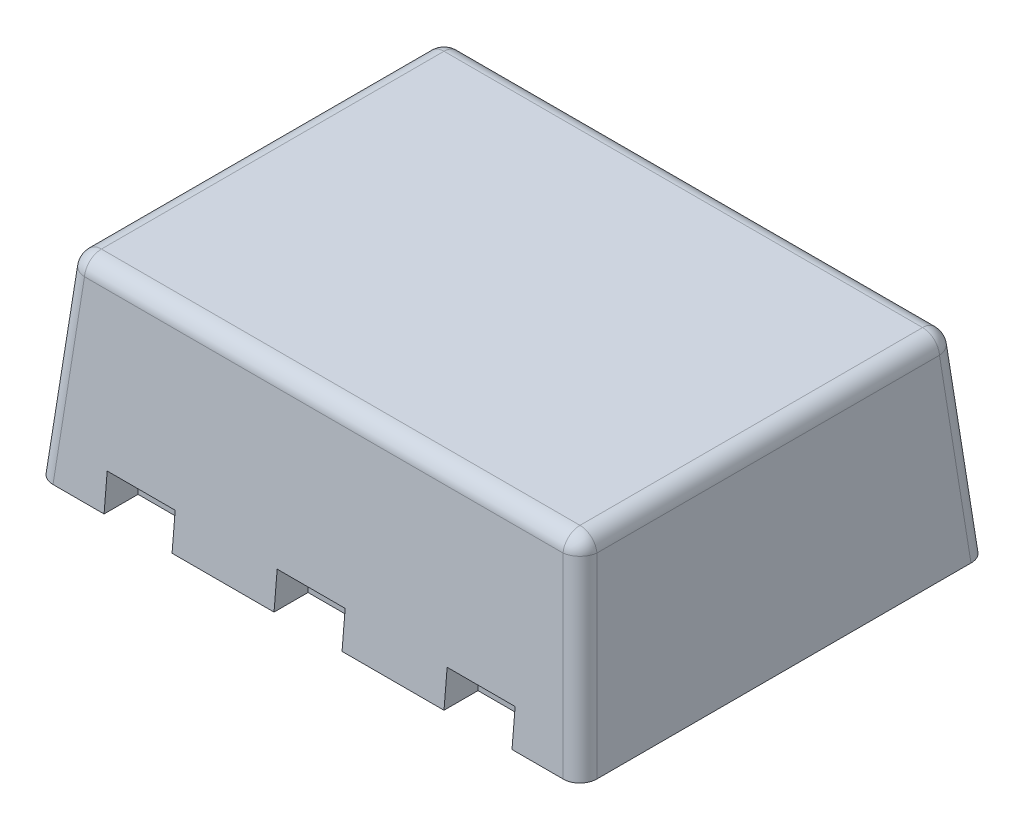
ISO-10303-21;
HEADER;
FILE_DESCRIPTION(('STEP AP214'),'2;1');
FILE_NAME('part.step','',(''),(''),'','','');
FILE_SCHEMA(('AUTOMOTIVE_DESIGN { 1 0 10303 214 1 1 1 1 }'));
ENDSEC;
DATA;
#1=APPLICATION_CONTEXT('core data for automotive mechanical design processes');
#2=APPLICATION_PROTOCOL_DEFINITION('international standard','automotive_design',2000,#1);
#3=PRODUCT_CONTEXT('',#1,'mechanical');
#4=PRODUCT('Part','Part','',(#3));
#5=PRODUCT_RELATED_PRODUCT_CATEGORY('part','',(#4));
#6=PRODUCT_DEFINITION_FORMATION('','',#4);
#7=PRODUCT_DEFINITION_CONTEXT('part definition',#1,'design');
#8=PRODUCT_DEFINITION('design','',#6,#7);
#9=PRODUCT_DEFINITION_SHAPE('','',#8);
#10=(LENGTH_UNIT() NAMED_UNIT(*) SI_UNIT(.MILLI.,.METRE.));
#11=(NAMED_UNIT(*) PLANE_ANGLE_UNIT() SI_UNIT($,.RADIAN.));
#12=(NAMED_UNIT(*) SI_UNIT($,.STERADIAN.) SOLID_ANGLE_UNIT());
#13=UNCERTAINTY_MEASURE_WITH_UNIT(LENGTH_MEASURE(1.E-05),#10,'distance_accuracy_value','');
#14=(GEOMETRIC_REPRESENTATION_CONTEXT(3) GLOBAL_UNCERTAINTY_ASSIGNED_CONTEXT((#13)) GLOBAL_UNIT_ASSIGNED_CONTEXT((#10,
#11,#12)) REPRESENTATION_CONTEXT('',''));
#15=CARTESIAN_POINT('',(0.,0.,0.));
#16=DIRECTION('',(0.,0.,1.));
#17=DIRECTION('',(1.,0.,0.));
#18=AXIS2_PLACEMENT_3D('',#15,#16,#17);
#19=CARTESIAN_POINT('',(0.,0.105,0.));
#20=DIRECTION('',(0.,-1.,0.));
#21=DIRECTION('',(0.,0.,-1.));
#22=AXIS2_PLACEMENT_3D('',#19,#20,#21);
#23=PLANE('',#22);
#24=DIRECTION('',(0.,0.,-1.));
#25=VECTOR('',#24,1.);
#26=CARTESIAN_POINT('',(-0.6,0.105,0.59081369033));
#27=LINE('',#26,#25);
#28=CARTESIAN_POINT('',(-0.6,0.105,0.59081369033));
#29=VERTEX_POINT('',#28);
#30=CARTESIAN_POINT('',(-0.6,0.105,0.5));
#31=VERTEX_POINT('',#30);
#32=EDGE_CURVE('E11',#29,#31,#27,.T.);
#33=ORIENTED_EDGE('',*,*,#32,.T.);
#34=DIRECTION('',(1.,0.,0.));
#35=VECTOR('',#34,1.);
#36=CARTESIAN_POINT('',(-0.6,0.105,0.5));
#37=LINE('',#36,#35);
#38=CARTESIAN_POINT('',(-0.4,0.105,0.5));
#39=VERTEX_POINT('',#38);
#40=EDGE_CURVE('E47',#31,#39,#37,.T.);
#41=ORIENTED_EDGE('',*,*,#40,.T.);
#42=DIRECTION('',(0.,0.,1.));
#43=VECTOR('',#42,1.);
#44=CARTESIAN_POINT('',(-0.4,0.105,0.5));
#45=LINE('',#44,#43);
#46=CARTESIAN_POINT('',(-0.4,0.105,0.59081369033));
#47=VERTEX_POINT('',#46);
#48=EDGE_CURVE('E463',#39,#47,#45,.T.);
#49=ORIENTED_EDGE('',*,*,#48,.T.);
#50=DIRECTION('',(1.,0.,0.));
#51=VECTOR('',#50,1.);
#52=CARTESIAN_POINT('',(-0.6,0.105,0.59081369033));
#53=LINE('',#52,#51);
#54=EDGE_CURVE('E407',#29,#47,#53,.T.);
#55=ORIENTED_EDGE('',*,*,#54,.F.);
#56=EDGE_LOOP('',(#33,#41,#49,#55));
#57=FACE_BOUND('',#56,.T.);
#58=ADVANCED_FACE('F17',(#57),#23,.T.);
#59=CARTESIAN_POINT('',(-0.6,-0.025,0.8));
#60=DIRECTION('',(1.,0.,0.));
#61=DIRECTION('',(0.,1.,0.));
#62=AXIS2_PLACEMENT_3D('',#59,#60,#61);
#63=PLANE('',#62);
#64=DIRECTION('',(0.,1.,0.));
#65=VECTOR('',#64,1.);
#66=CARTESIAN_POINT('',(-0.6,0.,0.5));
#67=LINE('',#66,#65);
#68=CARTESIAN_POINT('',(-0.6,0.,0.5));
#69=VERTEX_POINT('',#68);
#70=EDGE_CURVE('E26',#69,#31,#67,.T.);
#71=ORIENTED_EDGE('',*,*,#70,.T.);
#72=ORIENTED_EDGE('',*,*,#32,.F.);
#73=DIRECTION('',(0.,0.996194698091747,-0.0871557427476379));
#74=VECTOR('',#73,1.);
#75=CARTESIAN_POINT('',(-0.6,0.,0.6));
#76=LINE('',#75,#74);
#77=CARTESIAN_POINT('',(-0.6,0.,0.6));
#78=VERTEX_POINT('',#77);
#79=EDGE_CURVE('E403',#78,#29,#76,.T.);
#80=ORIENTED_EDGE('',*,*,#79,.F.);
#81=DIRECTION('',(0.,0.,-1.));
#82=VECTOR('',#81,1.);
#83=CARTESIAN_POINT('',(-0.6,0.,0.6));
#84=LINE('',#83,#82);
#85=EDGE_CURVE('E383',#78,#69,#84,.T.);
#86=ORIENTED_EDGE('',*,*,#85,.T.);
#87=EDGE_LOOP('',(#71,#72,#80,#86));
#88=FACE_BOUND('',#87,.T.);
#89=ADVANCED_FACE('F887',(#88),#63,.T.);
#90=CARTESIAN_POINT('',(-0.6,-0.025,0.5));
#91=DIRECTION('',(0.,0.,1.));
#92=DIRECTION('',(1.,0.,0.));
#93=AXIS2_PLACEMENT_3D('',#90,#91,#92);
#94=PLANE('',#93);
#95=DIRECTION('',(0.,1.,0.));
#96=VECTOR('',#95,1.);
#97=CARTESIAN_POINT('',(-0.4,0.,0.5));
#98=LINE('',#97,#96);
#99=CARTESIAN_POINT('',(-0.4,0.,0.5));
#100=VERTEX_POINT('',#99);
#101=EDGE_CURVE('E465',#100,#39,#98,.T.);
#102=ORIENTED_EDGE('',*,*,#101,.T.);
#103=ORIENTED_EDGE('',*,*,#40,.F.);
#104=ORIENTED_EDGE('',*,*,#70,.F.);
#105=DIRECTION('',(1.,0.,0.));
#106=VECTOR('',#105,1.);
#107=CARTESIAN_POINT('',(-0.6,0.,0.5));
#108=LINE('',#107,#106);
#109=EDGE_CURVE('E382',#69,#100,#108,.T.);
#110=ORIENTED_EDGE('',*,*,#109,.T.);
#111=EDGE_LOOP('',(#102,#103,#104,#110));
#112=FACE_BOUND('',#111,.T.);
#113=ADVANCED_FACE('F885',(#112),#94,.T.);
#114=CARTESIAN_POINT('',(-0.4,-0.025,0.5));
#115=DIRECTION('',(-1.,0.,0.));
#116=DIRECTION('',(0.,0.,1.));
#117=AXIS2_PLACEMENT_3D('',#114,#115,#116);
#118=PLANE('',#117);
#119=DIRECTION('',(0.,0.996194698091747,-0.0871557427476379));
#120=VECTOR('',#119,1.);
#121=CARTESIAN_POINT('',(-0.4,0.,0.6));
#122=LINE('',#121,#120);
#123=CARTESIAN_POINT('',(-0.4,0.,0.6));
#124=VERTEX_POINT('',#123);
#125=EDGE_CURVE('E587',#124,#47,#122,.T.);
#126=ORIENTED_EDGE('',*,*,#125,.T.);
#127=ORIENTED_EDGE('',*,*,#48,.F.);
#128=ORIENTED_EDGE('',*,*,#101,.F.);
#129=DIRECTION('',(0.,0.,-1.));
#130=VECTOR('',#129,1.);
#131=CARTESIAN_POINT('',(-0.4,0.,0.6));
#132=LINE('',#131,#130);
#133=EDGE_CURVE('E374',#124,#100,#132,.T.);
#134=ORIENTED_EDGE('',*,*,#133,.F.);
#135=EDGE_LOOP('',(#126,#127,#128,#134));
#136=FACE_BOUND('',#135,.T.);
#137=ADVANCED_FACE('F860',(#136),#118,.T.);
#138=CARTESIAN_POINT('',(0.,0.105,0.));
#139=DIRECTION('',(0.,-1.,0.));
#140=DIRECTION('',(0.,0.,-1.));
#141=AXIS2_PLACEMENT_3D('',#138,#139,#140);
#142=PLANE('',#141);
#143=DIRECTION('',(0.,0.,-1.));
#144=VECTOR('',#143,1.);
#145=CARTESIAN_POINT('',(-0.1,0.105,0.59081369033));
#146=LINE('',#145,#144);
#147=CARTESIAN_POINT('',(-0.1,0.105,0.59081369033));
#148=VERTEX_POINT('',#147);
#149=CARTESIAN_POINT('',(-0.1,0.105,0.5));
#150=VERTEX_POINT('',#149);
#151=EDGE_CURVE('E466',#148,#150,#146,.T.);
#152=ORIENTED_EDGE('',*,*,#151,.T.);
#153=DIRECTION('',(1.,0.,0.));
#154=VECTOR('',#153,1.);
#155=CARTESIAN_POINT('',(-0.1,0.105,0.5));
#156=LINE('',#155,#154);
#157=CARTESIAN_POINT('',(0.1,0.105,0.5));
#158=VERTEX_POINT('',#157);
#159=EDGE_CURVE('E77',#150,#158,#156,.T.);
#160=ORIENTED_EDGE('',*,*,#159,.T.);
#161=DIRECTION('',(0.,0.,1.));
#162=VECTOR('',#161,1.);
#163=CARTESIAN_POINT('',(0.1,0.105,0.5));
#164=LINE('',#163,#162);
#165=CARTESIAN_POINT('',(0.1,0.105,0.59081369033));
#166=VERTEX_POINT('',#165);
#167=EDGE_CURVE('E596',#158,#166,#164,.T.);
#168=ORIENTED_EDGE('',*,*,#167,.T.);
#169=DIRECTION('',(1.,0.,0.));
#170=VECTOR('',#169,1.);
#171=CARTESIAN_POINT('',(-0.1,0.105,0.59081369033));
#172=LINE('',#171,#170);
#173=EDGE_CURVE('E472',#148,#166,#172,.T.);
#174=ORIENTED_EDGE('',*,*,#173,.F.);
#175=EDGE_LOOP('',(#152,#160,#168,#174));
#176=FACE_BOUND('',#175,.T.);
#177=ADVANCED_FACE('F856',(#176),#142,.T.);
#178=CARTESIAN_POINT('',(-0.1,-0.025,0.8));
#179=DIRECTION('',(1.,0.,0.));
#180=DIRECTION('',(0.,1.,0.));
#181=AXIS2_PLACEMENT_3D('',#178,#179,#180);
#182=PLANE('',#181);
#183=DIRECTION('',(0.,1.,0.));
#184=VECTOR('',#183,1.);
#185=CARTESIAN_POINT('',(-0.1,0.,0.5));
#186=LINE('',#185,#184);
#187=CARTESIAN_POINT('',(-0.1,0.,0.5));
#188=VERTEX_POINT('',#187);
#189=EDGE_CURVE('E565',#188,#150,#186,.T.);
#190=ORIENTED_EDGE('',*,*,#189,.T.);
#191=ORIENTED_EDGE('',*,*,#151,.F.);
#192=DIRECTION('',(0.,0.996194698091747,-0.0871557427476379));
#193=VECTOR('',#192,1.);
#194=CARTESIAN_POINT('',(-0.1,0.,0.6));
#195=LINE('',#194,#193);
#196=CARTESIAN_POINT('',(-0.1,0.,0.6));
#197=VERTEX_POINT('',#196);
#198=EDGE_CURVE('E477',#197,#148,#195,.T.);
#199=ORIENTED_EDGE('',*,*,#198,.F.);
#200=DIRECTION('',(0.,0.,-1.));
#201=VECTOR('',#200,1.);
#202=CARTESIAN_POINT('',(-0.1,0.,0.6));
#203=LINE('',#202,#201);
#204=EDGE_CURVE('E354',#197,#188,#203,.T.);
#205=ORIENTED_EDGE('',*,*,#204,.T.);
#206=EDGE_LOOP('',(#190,#191,#199,#205));
#207=FACE_BOUND('',#206,.T.);
#208=ADVANCED_FACE('F859',(#207),#182,.T.);
#209=CARTESIAN_POINT('',(-0.1,-0.025,0.5));
#210=DIRECTION('',(0.,0.,1.));
#211=DIRECTION('',(1.,0.,0.));
#212=AXIS2_PLACEMENT_3D('',#209,#210,#211);
#213=PLANE('',#212);
#214=DIRECTION('',(0.,1.,0.));
#215=VECTOR('',#214,1.);
#216=CARTESIAN_POINT('',(0.1,0.,0.5));
#217=LINE('',#216,#215);
#218=CARTESIAN_POINT('',(0.1,0.,0.5));
#219=VERTEX_POINT('',#218);
#220=EDGE_CURVE('E566',#219,#158,#217,.T.);
#221=ORIENTED_EDGE('',*,*,#220,.T.);
#222=ORIENTED_EDGE('',*,*,#159,.F.);
#223=ORIENTED_EDGE('',*,*,#189,.F.);
#224=DIRECTION('',(1.,0.,0.));
#225=VECTOR('',#224,1.);
#226=CARTESIAN_POINT('',(-0.1,0.,0.5));
#227=LINE('',#226,#225);
#228=EDGE_CURVE('E359',#188,#219,#227,.T.);
#229=ORIENTED_EDGE('',*,*,#228,.T.);
#230=EDGE_LOOP('',(#221,#222,#223,#229));
#231=FACE_BOUND('',#230,.T.);
#232=ADVANCED_FACE('F876',(#231),#213,.T.);
#233=CARTESIAN_POINT('',(0.1,-0.025,0.5));
#234=DIRECTION('',(-1.,0.,0.));
#235=DIRECTION('',(0.,0.,1.));
#236=AXIS2_PLACEMENT_3D('',#233,#234,#235);
#237=PLANE('',#236);
#238=DIRECTION('',(0.,0.996194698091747,-0.0871557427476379));
#239=VECTOR('',#238,1.);
#240=CARTESIAN_POINT('',(0.1,0.,0.6));
#241=LINE('',#240,#239);
#242=CARTESIAN_POINT('',(0.1,0.,0.6));
#243=VERTEX_POINT('',#242);
#244=EDGE_CURVE('E476',#243,#166,#241,.T.);
#245=ORIENTED_EDGE('',*,*,#244,.T.);
#246=ORIENTED_EDGE('',*,*,#167,.F.);
#247=ORIENTED_EDGE('',*,*,#220,.F.);
#248=DIRECTION('',(0.,0.,-1.));
#249=VECTOR('',#248,1.);
#250=CARTESIAN_POINT('',(0.1,0.,0.6));
#251=LINE('',#250,#249);
#252=EDGE_CURVE('E378',#243,#219,#251,.T.);
#253=ORIENTED_EDGE('',*,*,#252,.F.);
#254=EDGE_LOOP('',(#245,#246,#247,#253));
#255=FACE_BOUND('',#254,.T.);
#256=ADVANCED_FACE('F873',(#255),#237,.T.);
#257=CARTESIAN_POINT('',(0.,0.105,0.));
#258=DIRECTION('',(0.,-1.,0.));
#259=DIRECTION('',(0.,0.,-1.));
#260=AXIS2_PLACEMENT_3D('',#257,#258,#259);
#261=PLANE('',#260);
#262=DIRECTION('',(0.,0.,-1.));
#263=VECTOR('',#262,1.);
#264=CARTESIAN_POINT('',(0.4,0.105,0.59081369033));
#265=LINE('',#264,#263);
#266=CARTESIAN_POINT('',(0.4,0.105,0.59081369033));
#267=VERTEX_POINT('',#266);
#268=CARTESIAN_POINT('',(0.4,0.105,0.5));
#269=VERTEX_POINT('',#268);
#270=EDGE_CURVE('E66',#267,#269,#265,.T.);
#271=ORIENTED_EDGE('',*,*,#270,.T.);
#272=DIRECTION('',(1.,0.,0.));
#273=VECTOR('',#272,1.);
#274=CARTESIAN_POINT('',(0.4,0.105,0.5));
#275=LINE('',#274,#273);
#276=CARTESIAN_POINT('',(0.6,0.105,0.5));
#277=VERTEX_POINT('',#276);
#278=EDGE_CURVE('E427',#269,#277,#275,.T.);
#279=ORIENTED_EDGE('',*,*,#278,.T.);
#280=DIRECTION('',(0.,0.,1.));
#281=VECTOR('',#280,1.);
#282=CARTESIAN_POINT('',(0.6,0.105,0.5));
#283=LINE('',#282,#281);
#284=CARTESIAN_POINT('',(0.6,0.105,0.59081369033));
#285=VERTEX_POINT('',#284);
#286=EDGE_CURVE('E428',#277,#285,#283,.T.);
#287=ORIENTED_EDGE('',*,*,#286,.T.);
#288=DIRECTION('',(1.,0.,0.));
#289=VECTOR('',#288,1.);
#290=CARTESIAN_POINT('',(0.4,0.105,0.59081369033));
#291=LINE('',#290,#289);
#292=EDGE_CURVE('E397',#267,#285,#291,.T.);
#293=ORIENTED_EDGE('',*,*,#292,.F.);
#294=EDGE_LOOP('',(#271,#279,#287,#293));
#295=FACE_BOUND('',#294,.T.);
#296=ADVANCED_FACE('F869',(#295),#261,.T.);
#297=CARTESIAN_POINT('',(0.4,-0.025,0.8));
#298=DIRECTION('',(1.,0.,0.));
#299=DIRECTION('',(0.,1.,0.));
#300=AXIS2_PLACEMENT_3D('',#297,#298,#299);
#301=PLANE('',#300);
#302=DIRECTION('',(0.,1.,0.));
#303=VECTOR('',#302,1.);
#304=CARTESIAN_POINT('',(0.4,0.,0.5));
#305=LINE('',#304,#303);
#306=CARTESIAN_POINT('',(0.4,0.,0.5));
#307=VERTEX_POINT('',#306);
#308=EDGE_CURVE('E514',#307,#269,#305,.T.);
#309=ORIENTED_EDGE('',*,*,#308,.T.);
#310=ORIENTED_EDGE('',*,*,#270,.F.);
#311=DIRECTION('',(0.,0.996194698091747,-0.0871557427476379));
#312=VECTOR('',#311,1.);
#313=CARTESIAN_POINT('',(0.4,0.,0.6));
#314=LINE('',#313,#312);
#315=CARTESIAN_POINT('',(0.4,0.,0.6));
#316=VERTEX_POINT('',#315);
#317=EDGE_CURVE('E402',#316,#267,#314,.T.);
#318=ORIENTED_EDGE('',*,*,#317,.F.);
#319=DIRECTION('',(0.,0.,-1.));
#320=VECTOR('',#319,1.);
#321=CARTESIAN_POINT('',(0.4,0.,0.6));
#322=LINE('',#321,#320);
#323=EDGE_CURVE('E366',#316,#307,#322,.T.);
#324=ORIENTED_EDGE('',*,*,#323,.T.);
#325=EDGE_LOOP('',(#309,#310,#318,#324));
#326=FACE_BOUND('',#325,.T.);
#327=ADVANCED_FACE('F757',(#326),#301,.T.);
#328=CARTESIAN_POINT('',(0.4,-0.025,0.5));
#329=DIRECTION('',(0.,0.,1.));
#330=DIRECTION('',(1.,0.,0.));
#331=AXIS2_PLACEMENT_3D('',#328,#329,#330);
#332=PLANE('',#331);
#333=DIRECTION('',(0.,1.,0.));
#334=VECTOR('',#333,1.);
#335=CARTESIAN_POINT('',(0.6,0.,0.5));
#336=LINE('',#335,#334);
#337=CARTESIAN_POINT('',(0.6,0.,0.5));
#338=VERTEX_POINT('',#337);
#339=EDGE_CURVE('E423',#338,#277,#336,.T.);
#340=ORIENTED_EDGE('',*,*,#339,.T.);
#341=ORIENTED_EDGE('',*,*,#278,.F.);
#342=ORIENTED_EDGE('',*,*,#308,.F.);
#343=DIRECTION('',(1.,0.,0.));
#344=VECTOR('',#343,1.);
#345=CARTESIAN_POINT('',(0.4,0.,0.5));
#346=LINE('',#345,#344);
#347=EDGE_CURVE('E346',#307,#338,#346,.T.);
#348=ORIENTED_EDGE('',*,*,#347,.T.);
#349=EDGE_LOOP('',(#340,#341,#342,#348));
#350=FACE_BOUND('',#349,.T.);
#351=ADVANCED_FACE('F753',(#350),#332,.T.);
#352=CARTESIAN_POINT('',(0.6,-0.025,0.5));
#353=DIRECTION('',(-1.,0.,0.));
#354=DIRECTION('',(0.,0.,1.));
#355=AXIS2_PLACEMENT_3D('',#352,#353,#354);
#356=PLANE('',#355);
#357=DIRECTION('',(0.,0.996194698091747,-0.0871557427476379));
#358=VECTOR('',#357,1.);
#359=CARTESIAN_POINT('',(0.6,0.,0.6));
#360=LINE('',#359,#358);
#361=CARTESIAN_POINT('',(0.6,0.,0.6));
#362=VERTEX_POINT('',#361);
#363=EDGE_CURVE('E401',#362,#285,#360,.T.);
#364=ORIENTED_EDGE('',*,*,#363,.T.);
#365=ORIENTED_EDGE('',*,*,#286,.F.);
#366=ORIENTED_EDGE('',*,*,#339,.F.);
#367=DIRECTION('',(0.,0.,-1.));
#368=VECTOR('',#367,1.);
#369=CARTESIAN_POINT('',(0.6,0.,0.6));
#370=LINE('',#369,#368);
#371=EDGE_CURVE('E713',#362,#338,#370,.T.);
#372=ORIENTED_EDGE('',*,*,#371,.F.);
#373=EDGE_LOOP('',(#364,#365,#366,#372));
#374=FACE_BOUND('',#373,.T.);
#375=ADVANCED_FACE('F756',(#374),#356,.T.);
#376=CARTESIAN_POINT('',(-0.703877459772,0.525,0.503877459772));
#377=DIRECTION('',(0.,-0.675590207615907,0.737277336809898));
#378=DIRECTION('',(0.,0.737277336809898,0.675590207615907));
#379=AXIS2_PLACEMENT_3D('',#376,#377,#378);
#380=SPHERICAL_SURFACE('',#379,0.05);
#381=CARTESIAN_POINT('',(-0.703877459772,0.525,0.503877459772));
#382=DIRECTION('',(0.,0.,1.));
#383=DIRECTION('',(0.,1.,0.));
#384=AXIS2_PLACEMENT_3D('',#381,#382,#383);
#385=CIRCLE('',#384,0.05);
#386=CARTESIAN_POINT('',(-0.703877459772,0.575,0.503877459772));
#387=VERTEX_POINT('',#386);
#388=CARTESIAN_POINT('',(-0.753687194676,0.529357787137,0.503877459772));
#389=VERTEX_POINT('',#388);
#390=EDGE_CURVE('E319',#387,#389,#385,.T.);
#391=ORIENTED_EDGE('',*,*,#390,.T.);
#392=CARTESIAN_POINT('',(-0.703877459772,0.525,0.503877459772));
#393=DIRECTION('',(0.0868265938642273,0.992432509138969,-0.0868265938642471));
#394=DIRECTION('',(-0.996194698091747,0.0871557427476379,0.));
#395=AXIS2_PLACEMENT_3D('',#392,#393,#394);
#396=CIRCLE('',#395,0.05);
#397=CARTESIAN_POINT('',(-0.703877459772,0.529357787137,0.553687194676));
#398=VERTEX_POINT('',#397);
#399=EDGE_CURVE('E603',#389,#398,#396,.T.);
#400=ORIENTED_EDGE('',*,*,#399,.T.);
#401=CARTESIAN_POINT('',(-0.703877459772,0.525,0.503877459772));
#402=DIRECTION('',(-1.,0.,0.));
#403=DIRECTION('',(0.,0.0871557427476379,0.996194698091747));
#404=AXIS2_PLACEMENT_3D('',#401,#402,#403);
#405=CIRCLE('',#404,0.05);
#406=EDGE_CURVE('E489',#398,#387,#405,.T.);
#407=ORIENTED_EDGE('',*,*,#406,.T.);
#408=EDGE_LOOP('',(#391,#400,#407));
#409=FACE_BOUND('',#408,.T.);
#410=ADVANCED_FACE('F854',(#409),#380,.T.);
#411=CARTESIAN_POINT('',(-2.88576,0.525,0.503877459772));
#412=DIRECTION('',(1.,0.,0.));
#413=DIRECTION('',(0.,1.,0.));
#414=AXIS2_PLACEMENT_3D('',#411,#412,#413);
#415=CYLINDRICAL_SURFACE('',#414,0.05);
#416=CARTESIAN_POINT('',(0.703877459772,0.525,0.503877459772));
#417=DIRECTION('',(1.,0.,0.));
#418=DIRECTION('',(0.,1.,0.));
#419=AXIS2_PLACEMENT_3D('',#416,#417,#418);
#420=CIRCLE('',#419,0.05);
#421=CARTESIAN_POINT('',(0.703877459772,0.575,0.503877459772));
#422=VERTEX_POINT('',#421);
#423=CARTESIAN_POINT('',(0.703877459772,0.529357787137,0.553687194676));
#424=VERTEX_POINT('',#423);
#425=EDGE_CURVE('E486',#422,#424,#420,.T.);
#426=ORIENTED_EDGE('',*,*,#425,.F.);
#427=DIRECTION('',(1.,0.,0.));
#428=VECTOR('',#427,1.);
#429=CARTESIAN_POINT('',(-0.703877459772,0.575,0.503877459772));
#430=LINE('',#429,#428);
#431=EDGE_CURVE('E321',#387,#422,#430,.T.);
#432=ORIENTED_EDGE('',*,*,#431,.F.);
#433=ORIENTED_EDGE('',*,*,#406,.F.);
#434=DIRECTION('',(1.,0.,0.));
#435=VECTOR('',#434,1.);
#436=CARTESIAN_POINT('',(-0.703877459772,0.529357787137,0.553687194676));
#437=LINE('',#436,#435);
#438=EDGE_CURVE('E499',#398,#424,#437,.T.);
#439=ORIENTED_EDGE('',*,*,#438,.T.);
#440=EDGE_LOOP('',(#426,#432,#433,#439));
#441=FACE_BOUND('',#440,.T.);
#442=ADVANCED_FACE('F850',(#441),#415,.T.);
#443=CARTESIAN_POINT('',(0.703877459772,0.525,0.503877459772));
#444=DIRECTION('',(0.737277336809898,-0.675590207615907,0.));
#445=DIRECTION('',(0.675590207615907,0.737277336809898,0.));
#446=AXIS2_PLACEMENT_3D('',#443,#444,#445);
#447=SPHERICAL_SURFACE('',#446,0.05);
#448=ORIENTED_EDGE('',*,*,#425,.T.);
#449=CARTESIAN_POINT('',(0.703877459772,0.525,0.503877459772));
#450=DIRECTION('',(-0.0868265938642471,0.992432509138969,-0.0868265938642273));
#451=DIRECTION('',(0.,0.0871557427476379,0.996194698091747));
#452=AXIS2_PLACEMENT_3D('',#449,#450,#451);
#453=CIRCLE('',#452,0.05);
#454=CARTESIAN_POINT('',(0.753687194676,0.529357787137,0.503877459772));
#455=VERTEX_POINT('',#454);
#456=EDGE_CURVE('E548',#424,#455,#453,.T.);
#457=ORIENTED_EDGE('',*,*,#456,.T.);
#458=CARTESIAN_POINT('',(0.703877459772,0.525,0.503877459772));
#459=DIRECTION('',(0.,0.,1.));
#460=DIRECTION('',(0.996194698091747,0.0871557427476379,0.));
#461=AXIS2_PLACEMENT_3D('',#458,#459,#460);
#462=CIRCLE('',#461,0.05);
#463=EDGE_CURVE('E394',#455,#422,#462,.T.);
#464=ORIENTED_EDGE('',*,*,#463,.T.);
#465=EDGE_LOOP('',(#448,#457,#464));
#466=FACE_BOUND('',#465,.T.);
#467=ADVANCED_FACE('F846',(#466),#447,.T.);
#468=CARTESIAN_POINT('',(0.703877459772,0.525,2.16432));
#469=DIRECTION('',(0.,0.,-1.));
#470=DIRECTION('',(0.,1.,0.));
#471=AXIS2_PLACEMENT_3D('',#468,#469,#470);
#472=CYLINDRICAL_SURFACE('',#471,0.05);
#473=CARTESIAN_POINT('',(0.703877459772,0.525,-0.503877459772));
#474=DIRECTION('',(0.,0.,-1.));
#475=DIRECTION('',(0.,1.,0.));
#476=AXIS2_PLACEMENT_3D('',#473,#474,#475);
#477=CIRCLE('',#476,0.05);
#478=CARTESIAN_POINT('',(0.703877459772,0.575,-0.503877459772));
#479=VERTEX_POINT('',#478);
#480=CARTESIAN_POINT('',(0.753687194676,0.529357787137,-0.503877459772));
#481=VERTEX_POINT('',#480);
#482=EDGE_CURVE('E391',#479,#481,#477,.T.);
#483=ORIENTED_EDGE('',*,*,#482,.F.);
#484=DIRECTION('',(0.,0.,-1.));
#485=VECTOR('',#484,1.);
#486=CARTESIAN_POINT('',(0.703877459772,0.575,0.503877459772));
#487=LINE('',#486,#485);
#488=EDGE_CURVE('E306',#422,#479,#487,.T.);
#489=ORIENTED_EDGE('',*,*,#488,.F.);
#490=ORIENTED_EDGE('',*,*,#463,.F.);
#491=DIRECTION('',(0.,0.,-1.));
#492=VECTOR('',#491,1.);
#493=CARTESIAN_POINT('',(0.753687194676,0.529357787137,0.503877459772));
#494=LINE('',#493,#492);
#495=EDGE_CURVE('E580',#455,#481,#494,.T.);
#496=ORIENTED_EDGE('',*,*,#495,.T.);
#497=EDGE_LOOP('',(#483,#489,#490,#496));
#498=FACE_BOUND('',#497,.T.);
#499=ADVANCED_FACE('F843',(#498),#472,.T.);
#500=CARTESIAN_POINT('',(0.703877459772,0.525,-0.503877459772));
#501=DIRECTION('',(0.,-0.675590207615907,-0.737277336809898));
#502=DIRECTION('',(0.,0.737277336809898,-0.675590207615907));
#503=AXIS2_PLACEMENT_3D('',#500,#501,#502);
#504=SPHERICAL_SURFACE('',#503,0.05);
#505=CARTESIAN_POINT('',(0.703877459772,0.525,-0.503877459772));
#506=DIRECTION('',(-0.0868265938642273,0.992432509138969,0.0868265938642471));
#507=DIRECTION('',(0.996194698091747,0.0871557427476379,0.));
#508=AXIS2_PLACEMENT_3D('',#505,#506,#507);
#509=CIRCLE('',#508,0.05);
#510=CARTESIAN_POINT('',(0.703877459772,0.529357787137,-0.553687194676));
#511=VERTEX_POINT('',#510);
#512=EDGE_CURVE('E567',#481,#511,#509,.T.);
#513=ORIENTED_EDGE('',*,*,#512,.T.);
#514=CARTESIAN_POINT('',(0.703877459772,0.525,-0.503877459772));
#515=DIRECTION('',(1.,0.,0.));
#516=DIRECTION('',(0.,0.0871557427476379,-0.996194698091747));
#517=AXIS2_PLACEMENT_3D('',#514,#515,#516);
#518=CIRCLE('',#517,0.05);
#519=EDGE_CURVE('E311',#511,#479,#518,.T.);
#520=ORIENTED_EDGE('',*,*,#519,.T.);
#521=ORIENTED_EDGE('',*,*,#482,.T.);
#522=EDGE_LOOP('',(#513,#520,#521));
#523=FACE_BOUND('',#522,.T.);
#524=ADVANCED_FACE('F842',(#523),#504,.T.);
#525=CARTESIAN_POINT('',(2.88576,0.525,-0.503877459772));
#526=DIRECTION('',(-1.,0.,0.));
#527=DIRECTION('',(0.,1.,0.));
#528=AXIS2_PLACEMENT_3D('',#525,#526,#527);
#529=CYLINDRICAL_SURFACE('',#528,0.05);
#530=ORIENTED_EDGE('',*,*,#519,.F.);
#531=DIRECTION('',(-1.,0.,0.));
#532=VECTOR('',#531,1.);
#533=CARTESIAN_POINT('',(0.703877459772,0.529357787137,-0.553687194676));
#534=LINE('',#533,#532);
#535=CARTESIAN_POINT('',(-0.703877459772,0.529357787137,-0.553687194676));
#536=VERTEX_POINT('',#535);
#537=EDGE_CURVE('E334',#511,#536,#534,.T.);
#538=ORIENTED_EDGE('',*,*,#537,.T.);
#539=CARTESIAN_POINT('',(-0.703877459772,0.525,-0.503877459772));
#540=DIRECTION('',(-1.,0.,0.));
#541=DIRECTION('',(0.,1.,0.));
#542=AXIS2_PLACEMENT_3D('',#539,#540,#541);
#543=CIRCLE('',#542,0.05);
#544=CARTESIAN_POINT('',(-0.703877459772,0.575,-0.503877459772));
#545=VERTEX_POINT('',#544);
#546=EDGE_CURVE('E325',#545,#536,#543,.T.);
#547=ORIENTED_EDGE('',*,*,#546,.F.);
#548=DIRECTION('',(-1.,0.,0.));
#549=VECTOR('',#548,1.);
#550=CARTESIAN_POINT('',(0.703877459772,0.575,-0.503877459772));
#551=LINE('',#550,#549);
#552=EDGE_CURVE('E299',#479,#545,#551,.T.);
#553=ORIENTED_EDGE('',*,*,#552,.F.);
#554=EDGE_LOOP('',(#530,#538,#547,#553));
#555=FACE_BOUND('',#554,.T.);
#556=ADVANCED_FACE('F332',(#555),#529,.T.);
#557=CARTESIAN_POINT('',(0.,0.575,0.));
#558=DIRECTION('',(0.,1.,0.));
#559=DIRECTION('',(1.,0.,0.));
#560=AXIS2_PLACEMENT_3D('',#557,#558,#559);
#561=PLANE('',#560);
#562=DIRECTION('',(0.,0.,1.));
#563=VECTOR('',#562,1.);
#564=CARTESIAN_POINT('',(-0.703877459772,0.575,-0.503877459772));
#565=LINE('',#564,#563);
#566=EDGE_CURVE('E303',#545,#387,#565,.T.);
#567=ORIENTED_EDGE('',*,*,#566,.T.);
#568=ORIENTED_EDGE('',*,*,#431,.T.);
#569=ORIENTED_EDGE('',*,*,#488,.T.);
#570=ORIENTED_EDGE('',*,*,#552,.T.);
#571=EDGE_LOOP('',(#567,#568,#569,#570));
#572=FACE_BOUND('',#571,.T.);
#573=ADVANCED_FACE('F301',(#572),#561,.T.);
#574=CARTESIAN_POINT('',(-0.703877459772,0.525,-2.16432));
#575=DIRECTION('',(0.,0.,1.));
#576=DIRECTION('',(0.,1.,0.));
#577=AXIS2_PLACEMENT_3D('',#574,#575,#576);
#578=CYLINDRICAL_SURFACE('',#577,0.05);
#579=ORIENTED_EDGE('',*,*,#390,.F.);
#580=ORIENTED_EDGE('',*,*,#566,.F.);
#581=CARTESIAN_POINT('',(-0.703877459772,0.525,-0.503877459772));
#582=DIRECTION('',(0.,0.,-1.));
#583=DIRECTION('',(-0.996194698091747,0.0871557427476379,0.));
#584=AXIS2_PLACEMENT_3D('',#581,#582,#583);
#585=CIRCLE('',#584,0.05);
#586=CARTESIAN_POINT('',(-0.753687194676,0.529357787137,-0.503877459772));
#587=VERTEX_POINT('',#586);
#588=EDGE_CURVE('E317',#587,#545,#585,.T.);
#589=ORIENTED_EDGE('',*,*,#588,.F.);
#590=DIRECTION('',(0.,0.,1.));
#591=VECTOR('',#590,1.);
#592=CARTESIAN_POINT('',(-0.753687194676,0.529357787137,-0.503877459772));
#593=LINE('',#592,#591);
#594=EDGE_CURVE('E608',#587,#389,#593,.T.);
#595=ORIENTED_EDGE('',*,*,#594,.T.);
#596=EDGE_LOOP('',(#579,#580,#589,#595));
#597=FACE_BOUND('',#596,.T.);
#598=ADVANCED_FACE('F315',(#597),#578,.T.);
#599=CARTESIAN_POINT('',(-0.703877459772,0.525,-0.503877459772));
#600=DIRECTION('',(0.707106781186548,0.,-0.707106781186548));
#601=DIRECTION('',(-0.701755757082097,0.122791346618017,-0.701755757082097));
#602=AXIS2_PLACEMENT_3D('',#599,#600,#601);
#603=SPHERICAL_SURFACE('',#602,0.05);
#604=ORIENTED_EDGE('',*,*,#546,.T.);
#605=CARTESIAN_POINT('',(-0.703877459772,0.525,-0.503877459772));
#606=DIRECTION('',(0.0868265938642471,0.992432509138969,0.0868265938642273));
#607=DIRECTION('',(0.,0.0871557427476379,-0.996194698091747));
#608=AXIS2_PLACEMENT_3D('',#605,#606,#607);
#609=CIRCLE('',#608,0.05);
#610=EDGE_CURVE('E327',#536,#587,#609,.T.);
#611=ORIENTED_EDGE('',*,*,#610,.T.);
#612=ORIENTED_EDGE('',*,*,#588,.T.);
#613=EDGE_LOOP('',(#604,#611,#612));
#614=FACE_BOUND('',#613,.T.);
#615=ADVANCED_FACE('F324',(#614),#603,.T.);
#616=CARTESIAN_POINT('',(-0.633924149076,1.32457,-0.433924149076));
#617=DIRECTION('',(-0.0868265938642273,-0.992432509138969,-0.0868265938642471));
#618=DIRECTION('',(-0.996194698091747,0.0871557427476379,0.));
#619=AXIS2_PLACEMENT_3D('',#616,#617,#618);
#620=CYLINDRICAL_SURFACE('',#619,0.05);
#621=DIRECTION('',(-0.0868265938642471,-0.992432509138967,-0.0868265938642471));
#622=VECTOR('',#621,1.);
#623=CARTESIAN_POINT('',(-0.753687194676,0.529357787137,-0.503877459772));
#624=LINE('',#623,#622);
#625=CARTESIAN_POINT('',(-0.8,0.,-0.550190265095));
#626=VERTEX_POINT('',#625);
#627=EDGE_CURVE('E342',#587,#626,#624,.T.);
#628=ORIENTED_EDGE('',*,*,#627,.F.);
#629=ORIENTED_EDGE('',*,*,#610,.F.);
#630=DIRECTION('',(-0.0868265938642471,-0.992432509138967,-0.0868265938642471));
#631=VECTOR('',#630,1.);
#632=CARTESIAN_POINT('',(-0.703877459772,0.529357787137,-0.553687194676));
#633=LINE('',#632,#631);
#634=CARTESIAN_POINT('',(-0.750190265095,0.,-0.6));
#635=VERTEX_POINT('',#634);
#636=EDGE_CURVE('E485',#536,#635,#633,.T.);
#637=ORIENTED_EDGE('',*,*,#636,.T.);
#638=CARTESIAN_POINT('',(-0.8,0.,-0.550190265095));
#639=CARTESIAN_POINT('',(-0.8,0.,-0.570539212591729));
#640=CARTESIAN_POINT('',(-0.7854339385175,0.,-0.5854339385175));
#641=CARTESIAN_POINT('',(-0.771189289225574,0.,-0.6));
#642=CARTESIAN_POINT('',(-0.750190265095,0.,-0.6));
#643=B_SPLINE_CURVE_WITH_KNOTS('',2,(#638,#639,#640,#641,#642),.UNSPECIFIED.,.F.,.F.,(3,2,3),
(0.,0.5,1.),.UNSPECIFIED.);
#644=EDGE_CURVE('E637',#626,#635,#643,.T.);
#645=ORIENTED_EDGE('',*,*,#644,.F.);
#646=EDGE_LOOP('',(#628,#629,#637,#645));
#647=FACE_BOUND('',#646,.T.);
#648=ADVANCED_FACE('F824',(#647),#620,.T.);
#649=CARTESIAN_POINT('',(-0.8,0.,-1.6264));
#650=DIRECTION('',(-0.996194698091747,0.0871557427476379,0.));
#651=DIRECTION('',(0.,0.,1.));
#652=AXIS2_PLACEMENT_3D('',#649,#650,#651);
#653=PLANE('',#652);
#654=DIRECTION('',(0.,0.,-1.));
#655=VECTOR('',#654,1.);
#656=CARTESIAN_POINT('',(-0.8,0.,0.550190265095));
#657=LINE('',#656,#655);
#658=CARTESIAN_POINT('',(-0.8,0.,0.550190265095));
#659=VERTEX_POINT('',#658);
#660=EDGE_CURVE('E802',#659,#626,#657,.T.);
#661=ORIENTED_EDGE('',*,*,#660,.F.);
#662=DIRECTION('',(-0.0868265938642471,-0.992432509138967,0.0868265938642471));
#663=VECTOR('',#662,1.);
#664=CARTESIAN_POINT('',(-0.753687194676,0.529357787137,0.503877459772));
#665=LINE('',#664,#663);
#666=EDGE_CURVE('E607',#389,#659,#665,.T.);
#667=ORIENTED_EDGE('',*,*,#666,.F.);
#668=ORIENTED_EDGE('',*,*,#594,.F.);
#669=ORIENTED_EDGE('',*,*,#627,.T.);
#670=EDGE_LOOP('',(#661,#667,#668,#669));
#671=FACE_BOUND('',#670,.T.);
#672=ADVANCED_FACE('F767',(#671),#653,.T.);
#673=CARTESIAN_POINT('',(-0.633924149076,1.32457,0.433924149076));
#674=DIRECTION('',(-0.0868265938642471,-0.992432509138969,0.0868265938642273));
#675=DIRECTION('',(0.,0.0871557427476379,0.996194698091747));
#676=AXIS2_PLACEMENT_3D('',#673,#674,#675);
#677=CYLINDRICAL_SURFACE('',#676,0.05);
#678=DIRECTION('',(-0.0868265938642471,-0.992432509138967,0.0868265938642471));
#679=VECTOR('',#678,1.);
#680=CARTESIAN_POINT('',(-0.703877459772,0.529357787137,0.553687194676));
#681=LINE('',#680,#679);
#682=CARTESIAN_POINT('',(-0.750190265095,0.,0.6));
#683=VERTEX_POINT('',#682);
#684=EDGE_CURVE('E503',#398,#683,#681,.T.);
#685=ORIENTED_EDGE('',*,*,#684,.F.);
#686=ORIENTED_EDGE('',*,*,#399,.F.);
#687=ORIENTED_EDGE('',*,*,#666,.T.);
#688=CARTESIAN_POINT('',(-0.750190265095,0.,0.6));
#689=CARTESIAN_POINT('',(-0.770539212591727,0.,0.6));
#690=CARTESIAN_POINT('',(-0.7854339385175,0.,0.5854339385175));
#691=CARTESIAN_POINT('',(-0.8,0.,0.571189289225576));
#692=CARTESIAN_POINT('',(-0.8,0.,0.550190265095));
#693=B_SPLINE_CURVE_WITH_KNOTS('',2,(#688,#689,#690,#691,#692),.UNSPECIFIED.,.F.,.F.,(3,2,3),
(0.,0.5,1.),.UNSPECIFIED.);
#694=EDGE_CURVE('E787',#683,#659,#693,.T.);
#695=ORIENTED_EDGE('',*,*,#694,.F.);
#696=EDGE_LOOP('',(#685,#686,#687,#695));
#697=FACE_BOUND('',#696,.T.);
#698=ADVANCED_FACE('F762',(#697),#677,.T.);
#699=CARTESIAN_POINT('',(-1.8264,0.,0.6));
#700=DIRECTION('',(0.,0.0871557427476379,0.996194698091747));
#701=DIRECTION('',(1.,0.,0.));
#702=AXIS2_PLACEMENT_3D('',#699,#700,#701);
#703=PLANE('',#702);
#704=ORIENTED_EDGE('',*,*,#79,.T.);
#705=ORIENTED_EDGE('',*,*,#54,.T.);
#706=ORIENTED_EDGE('',*,*,#125,.F.);
#707=DIRECTION('',(1.,0.,0.));
#708=VECTOR('',#707,1.);
#709=CARTESIAN_POINT('',(-0.4,0.,0.6));
#710=LINE('',#709,#708);
#711=EDGE_CURVE('E358',#124,#197,#710,.T.);
#712=ORIENTED_EDGE('',*,*,#711,.T.);
#713=ORIENTED_EDGE('',*,*,#198,.T.);
#714=ORIENTED_EDGE('',*,*,#173,.T.);
#715=ORIENTED_EDGE('',*,*,#244,.F.);
#716=DIRECTION('',(1.,0.,0.));
#717=VECTOR('',#716,1.);
#718=CARTESIAN_POINT('',(0.1,0.,0.6));
#719=LINE('',#718,#717);
#720=EDGE_CURVE('E370',#243,#316,#719,.T.);
#721=ORIENTED_EDGE('',*,*,#720,.T.);
#722=ORIENTED_EDGE('',*,*,#317,.T.);
#723=ORIENTED_EDGE('',*,*,#292,.T.);
#724=ORIENTED_EDGE('',*,*,#363,.F.);
#725=DIRECTION('',(1.,0.,0.));
#726=VECTOR('',#725,1.);
#727=CARTESIAN_POINT('',(0.6,0.,0.6));
#728=LINE('',#727,#726);
#729=CARTESIAN_POINT('',(0.750190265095,0.,0.6));
#730=VERTEX_POINT('',#729);
#731=EDGE_CURVE('E709',#362,#730,#728,.T.);
#732=ORIENTED_EDGE('',*,*,#731,.T.);
#733=DIRECTION('',(0.0868265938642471,-0.992432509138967,0.0868265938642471));
#734=VECTOR('',#733,1.);
#735=CARTESIAN_POINT('',(0.703877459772,0.529357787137,0.553687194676));
#736=LINE('',#735,#734);
#737=EDGE_CURVE('E408',#424,#730,#736,.T.);
#738=ORIENTED_EDGE('',*,*,#737,.F.);
#739=ORIENTED_EDGE('',*,*,#438,.F.);
#740=ORIENTED_EDGE('',*,*,#684,.T.);
#741=DIRECTION('',(1.,0.,0.));
#742=VECTOR('',#741,1.);
#743=CARTESIAN_POINT('',(-0.750190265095,0.,0.6));
#744=LINE('',#743,#742);
#745=EDGE_CURVE('E387',#683,#78,#744,.T.);
#746=ORIENTED_EDGE('',*,*,#745,.T.);
#747=EDGE_LOOP('',(#704,#705,#706,#712,#713,#714,#715,#721,#722,#723,#724,#732,#738,#739,#740,#746));
#748=FACE_BOUND('',#747,.T.);
#749=ADVANCED_FACE('F759',(#748),#703,.T.);
#750=CARTESIAN_POINT('',(0.633924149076,1.32457,0.433924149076));
#751=DIRECTION('',(0.0868265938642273,-0.992432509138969,0.0868265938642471));
#752=DIRECTION('',(0.996194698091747,0.0871557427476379,0.));
#753=AXIS2_PLACEMENT_3D('',#750,#751,#752);
#754=CYLINDRICAL_SURFACE('',#753,0.05);
#755=DIRECTION('',(0.0868265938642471,-0.992432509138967,0.0868265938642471));
#756=VECTOR('',#755,1.);
#757=CARTESIAN_POINT('',(0.753687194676,0.529357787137,0.503877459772));
#758=LINE('',#757,#756);
#759=CARTESIAN_POINT('',(0.8,0.,0.550190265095));
#760=VERTEX_POINT('',#759);
#761=EDGE_CURVE('E552',#455,#760,#758,.T.);
#762=ORIENTED_EDGE('',*,*,#761,.F.);
#763=ORIENTED_EDGE('',*,*,#456,.F.);
#764=ORIENTED_EDGE('',*,*,#737,.T.);
#765=CARTESIAN_POINT('',(0.8,0.,0.550190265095));
#766=CARTESIAN_POINT('',(0.8,0.,0.570539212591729));
#767=CARTESIAN_POINT('',(0.7854339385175,0.,0.5854339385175));
#768=CARTESIAN_POINT('',(0.771189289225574,0.,0.6));
#769=CARTESIAN_POINT('',(0.750190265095,0.,0.6));
#770=B_SPLINE_CURVE_WITH_KNOTS('',2,(#765,#766,#767,#768,#769),.UNSPECIFIED.,.F.,.F.,(3,2,3),
(0.,0.5,1.),.UNSPECIFIED.);
#771=EDGE_CURVE('E684',#760,#730,#770,.T.);
#772=ORIENTED_EDGE('',*,*,#771,.F.);
#773=EDGE_LOOP('',(#762,#763,#764,#772));
#774=FACE_BOUND('',#773,.T.);
#775=ADVANCED_FACE('F656',(#774),#754,.T.);
#776=CARTESIAN_POINT('',(0.8,0.,1.6264));
#777=DIRECTION('',(0.996194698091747,0.0871557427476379,0.));
#778=DIRECTION('',(0.,0.,-1.));
#779=AXIS2_PLACEMENT_3D('',#776,#777,#778);
#780=PLANE('',#779);
#781=ORIENTED_EDGE('',*,*,#495,.F.);
#782=ORIENTED_EDGE('',*,*,#761,.T.);
#783=DIRECTION('',(0.,0.,-1.));
#784=VECTOR('',#783,1.);
#785=CARTESIAN_POINT('',(0.8,0.,0.550190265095));
#786=LINE('',#785,#784);
#787=CARTESIAN_POINT('',(0.8,0.,-0.550190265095));
#788=VERTEX_POINT('',#787);
#789=EDGE_CURVE('E698',#760,#788,#786,.T.);
#790=ORIENTED_EDGE('',*,*,#789,.T.);
#791=DIRECTION('',(0.0868265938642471,-0.992432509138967,-0.0868265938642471));
#792=VECTOR('',#791,1.);
#793=CARTESIAN_POINT('',(0.753687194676,0.529357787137,-0.503877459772));
#794=LINE('',#793,#792);
#795=EDGE_CURVE('E571',#481,#788,#794,.T.);
#796=ORIENTED_EDGE('',*,*,#795,.F.);
#797=EDGE_LOOP('',(#781,#782,#790,#796));
#798=FACE_BOUND('',#797,.T.);
#799=ADVANCED_FACE('F748',(#798),#780,.T.);
#800=CARTESIAN_POINT('',(0.633924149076,1.32457,-0.433924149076));
#801=DIRECTION('',(0.0868265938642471,-0.992432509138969,-0.0868265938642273));
#802=DIRECTION('',(0.,0.0871557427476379,-0.996194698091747));
#803=AXIS2_PLACEMENT_3D('',#800,#801,#802);
#804=CYLINDRICAL_SURFACE('',#803,0.05);
#805=DIRECTION('',(0.0868265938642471,-0.992432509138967,-0.0868265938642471));
#806=VECTOR('',#805,1.);
#807=CARTESIAN_POINT('',(0.703877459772,0.529357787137,-0.553687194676));
#808=LINE('',#807,#806);
#809=CARTESIAN_POINT('',(0.750190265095,0.,-0.6));
#810=VERTEX_POINT('',#809);
#811=EDGE_CURVE('E498',#511,#810,#808,.T.);
#812=ORIENTED_EDGE('',*,*,#811,.F.);
#813=ORIENTED_EDGE('',*,*,#512,.F.);
#814=ORIENTED_EDGE('',*,*,#795,.T.);
#815=CARTESIAN_POINT('',(0.750190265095,0.,-0.6));
#816=CARTESIAN_POINT('',(0.770539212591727,0.,-0.6));
#817=CARTESIAN_POINT('',(0.7854339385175,0.,-0.5854339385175));
#818=CARTESIAN_POINT('',(0.8,0.,-0.571189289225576));
#819=CARTESIAN_POINT('',(0.8,0.,-0.550190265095));
#820=B_SPLINE_CURVE_WITH_KNOTS('',2,(#815,#816,#817,#818,#819),.UNSPECIFIED.,.F.,.F.,(3,2,3),
(0.,0.5,1.),.UNSPECIFIED.);
#821=EDGE_CURVE('E702',#810,#788,#820,.T.);
#822=ORIENTED_EDGE('',*,*,#821,.F.);
#823=EDGE_LOOP('',(#812,#813,#814,#822));
#824=FACE_BOUND('',#823,.T.);
#825=ADVANCED_FACE('F737',(#824),#804,.T.);
#826=CARTESIAN_POINT('',(0.,0.105,0.));
#827=DIRECTION('',(0.,1.,0.));
#828=DIRECTION('',(1.,0.,0.));
#829=AXIS2_PLACEMENT_3D('',#826,#827,#828);
#830=PLANE('',#829);
#831=DIRECTION('',(1.,0.,0.));
#832=VECTOR('',#831,1.);
#833=CARTESIAN_POINT('',(0.4,0.105,-0.59081369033));
#834=LINE('',#833,#832);
#835=CARTESIAN_POINT('',(0.4,0.105,-0.59081369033));
#836=VERTEX_POINT('',#835);
#837=CARTESIAN_POINT('',(0.6,0.105,-0.59081369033));
#838=VERTEX_POINT('',#837);
#839=EDGE_CURVE('E504',#836,#838,#834,.T.);
#840=ORIENTED_EDGE('',*,*,#839,.T.);
#841=DIRECTION('',(0.,0.,-1.));
#842=VECTOR('',#841,1.);
#843=CARTESIAN_POINT('',(0.6,0.105,-0.5));
#844=LINE('',#843,#842);
#845=CARTESIAN_POINT('',(0.6,0.105,-0.5));
#846=VERTEX_POINT('',#845);
#847=EDGE_CURVE('E471',#846,#838,#844,.T.);
#848=ORIENTED_EDGE('',*,*,#847,.F.);
#849=DIRECTION('',(1.,0.,0.));
#850=VECTOR('',#849,1.);
#851=CARTESIAN_POINT('',(0.4,0.105,-0.5));
#852=LINE('',#851,#850);
#853=CARTESIAN_POINT('',(0.4,0.105,-0.5));
#854=VERTEX_POINT('',#853);
#855=EDGE_CURVE('E458',#854,#846,#852,.T.);
#856=ORIENTED_EDGE('',*,*,#855,.F.);
#857=DIRECTION('',(0.,0.,1.));
#858=VECTOR('',#857,1.);
#859=CARTESIAN_POINT('',(0.4,0.105,-0.59081369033));
#860=LINE('',#859,#858);
#861=EDGE_CURVE('E360',#836,#854,#860,.T.);
#862=ORIENTED_EDGE('',*,*,#861,.F.);
#863=EDGE_LOOP('',(#840,#848,#856,#862));
#864=FACE_BOUND('',#863,.T.);
#865=ADVANCED_FACE('F747',(#864),#830,.F.);
#866=CARTESIAN_POINT('',(0.,0.105,0.));
#867=DIRECTION('',(0.,1.,0.));
#868=DIRECTION('',(1.,0.,0.));
#869=AXIS2_PLACEMENT_3D('',#866,#867,#868);
#870=PLANE('',#869);
#871=DIRECTION('',(1.,0.,0.));
#872=VECTOR('',#871,1.);
#873=CARTESIAN_POINT('',(-0.1,0.105,-0.59081369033));
#874=LINE('',#873,#872);
#875=CARTESIAN_POINT('',(-0.1,0.105,-0.59081369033));
#876=VERTEX_POINT('',#875);
#877=CARTESIAN_POINT('',(0.1,0.105,-0.59081369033));
#878=VERTEX_POINT('',#877);
#879=EDGE_CURVE('E513',#876,#878,#874,.T.);
#880=ORIENTED_EDGE('',*,*,#879,.T.);
#881=DIRECTION('',(0.,0.,-1.));
#882=VECTOR('',#881,1.);
#883=CARTESIAN_POINT('',(0.1,0.105,-0.5));
#884=LINE('',#883,#882);
#885=CARTESIAN_POINT('',(0.1,0.105,-0.5));
#886=VERTEX_POINT('',#885);
#887=EDGE_CURVE('E352',#886,#878,#884,.T.);
#888=ORIENTED_EDGE('',*,*,#887,.F.);
#889=DIRECTION('',(1.,0.,0.));
#890=VECTOR('',#889,1.);
#891=CARTESIAN_POINT('',(-0.1,0.105,-0.5));
#892=LINE('',#891,#890);
#893=CARTESIAN_POINT('',(-0.1,0.105,-0.5));
#894=VERTEX_POINT('',#893);
#895=EDGE_CURVE('E353',#894,#886,#892,.T.);
#896=ORIENTED_EDGE('',*,*,#895,.F.);
#897=DIRECTION('',(0.,0.,1.));
#898=VECTOR('',#897,1.);
#899=CARTESIAN_POINT('',(-0.1,0.105,-0.59081369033));
#900=LINE('',#899,#898);
#901=EDGE_CURVE('E555',#876,#894,#900,.T.);
#902=ORIENTED_EDGE('',*,*,#901,.F.);
#903=EDGE_LOOP('',(#880,#888,#896,#902));
#904=FACE_BOUND('',#903,.T.);
#905=ADVANCED_FACE('F654',(#904),#870,.F.);
#906=CARTESIAN_POINT('',(0.1,-0.025,-0.5));
#907=DIRECTION('',(1.,0.,0.));
#908=DIRECTION('',(0.,1.,0.));
#909=AXIS2_PLACEMENT_3D('',#906,#907,#908);
#910=PLANE('',#909);
#911=DIRECTION('',(0.,1.,0.));
#912=VECTOR('',#911,1.);
#913=CARTESIAN_POINT('',(0.1,0.,-0.5));
#914=LINE('',#913,#912);
#915=CARTESIAN_POINT('',(0.1,0.,-0.5));
#916=VERTEX_POINT('',#915);
#917=EDGE_CURVE('E348',#916,#886,#914,.T.);
#918=ORIENTED_EDGE('',*,*,#917,.T.);
#919=ORIENTED_EDGE('',*,*,#887,.T.);
#920=DIRECTION('',(0.,0.996194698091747,0.0871557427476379));
#921=VECTOR('',#920,1.);
#922=CARTESIAN_POINT('',(0.1,0.,-0.6));
#923=LINE('',#922,#921);
#924=CARTESIAN_POINT('',(0.1,0.,-0.6));
#925=VERTEX_POINT('',#924);
#926=EDGE_CURVE('E507',#925,#878,#923,.T.);
#927=ORIENTED_EDGE('',*,*,#926,.F.);
#928=DIRECTION('',(0.,0.,-1.));
#929=VECTOR('',#928,1.);
#930=CARTESIAN_POINT('',(0.1,0.,-0.5));
#931=LINE('',#930,#929);
#932=EDGE_CURVE('E436',#916,#925,#931,.T.);
#933=ORIENTED_EDGE('',*,*,#932,.F.);
#934=EDGE_LOOP('',(#918,#919,#927,#933));
#935=FACE_BOUND('',#934,.T.);
#936=ADVANCED_FACE('F1262',(#935),#910,.F.);
#937=CARTESIAN_POINT('',(-0.1,-0.025,-0.5));
#938=DIRECTION('',(0.,0.,1.));
#939=DIRECTION('',(1.,0.,0.));
#940=AXIS2_PLACEMENT_3D('',#937,#938,#939);
#941=PLANE('',#940);
#942=DIRECTION('',(0.,1.,0.));
#943=VECTOR('',#942,1.);
#944=CARTESIAN_POINT('',(-0.1,0.,-0.5));
#945=LINE('',#944,#943);
#946=CARTESIAN_POINT('',(-0.1,0.,-0.5));
#947=VERTEX_POINT('',#946);
#948=EDGE_CURVE('E559',#947,#894,#945,.T.);
#949=ORIENTED_EDGE('',*,*,#948,.T.);
#950=ORIENTED_EDGE('',*,*,#895,.T.);
#951=ORIENTED_EDGE('',*,*,#917,.F.);
#952=DIRECTION('',(1.,0.,0.));
#953=VECTOR('',#952,1.);
#954=CARTESIAN_POINT('',(-0.1,0.,-0.5));
#955=LINE('',#954,#953);
#956=EDGE_CURVE('E433',#947,#916,#955,.T.);
#957=ORIENTED_EDGE('',*,*,#956,.F.);
#958=EDGE_LOOP('',(#949,#950,#951,#957));
#959=FACE_BOUND('',#958,.T.);
#960=ADVANCED_FACE('F1359',(#959),#941,.F.);
#961=CARTESIAN_POINT('',(-0.1,-0.025,-0.8));
#962=DIRECTION('',(-1.,0.,0.));
#963=DIRECTION('',(0.,0.,1.));
#964=AXIS2_PLACEMENT_3D('',#961,#962,#963);
#965=PLANE('',#964);
#966=DIRECTION('',(0.,0.996194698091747,0.0871557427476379));
#967=VECTOR('',#966,1.);
#968=CARTESIAN_POINT('',(-0.1,0.,-0.6));
#969=LINE('',#968,#967);
#970=CARTESIAN_POINT('',(-0.1,0.,-0.6));
#971=VERTEX_POINT('',#970);
#972=EDGE_CURVE('E520',#971,#876,#969,.T.);
#973=ORIENTED_EDGE('',*,*,#972,.T.);
#974=ORIENTED_EDGE('',*,*,#901,.T.);
#975=ORIENTED_EDGE('',*,*,#948,.F.);
#976=DIRECTION('',(0.,0.,-1.));
#977=VECTOR('',#976,1.);
#978=CARTESIAN_POINT('',(-0.1,0.,-0.5));
#979=LINE('',#978,#977);
#980=EDGE_CURVE('E432',#947,#971,#979,.T.);
#981=ORIENTED_EDGE('',*,*,#980,.T.);
#982=EDGE_LOOP('',(#973,#974,#975,#981));
#983=FACE_BOUND('',#982,.T.);
#984=ADVANCED_FACE('F1333',(#983),#965,.F.);
#985=CARTESIAN_POINT('',(0.,0.105,0.));
#986=DIRECTION('',(0.,1.,0.));
#987=DIRECTION('',(1.,0.,0.));
#988=AXIS2_PLACEMENT_3D('',#985,#986,#987);
#989=PLANE('',#988);
#990=DIRECTION('',(1.,0.,0.));
#991=VECTOR('',#990,1.);
#992=CARTESIAN_POINT('',(-0.6,0.105,-0.59081369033));
#993=LINE('',#992,#991);
#994=CARTESIAN_POINT('',(-0.6,0.105,-0.59081369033));
#995=VERTEX_POINT('',#994);
#996=CARTESIAN_POINT('',(-0.4,0.105,-0.59081369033));
#997=VERTEX_POINT('',#996);
#998=EDGE_CURVE('E495',#995,#997,#993,.T.);
#999=ORIENTED_EDGE('',*,*,#998,.T.);
#1000=DIRECTION('',(0.,0.,-1.));
#1001=VECTOR('',#1000,1.);
#1002=CARTESIAN_POINT('',(-0.4,0.105,-0.5));
#1003=LINE('',#1002,#1001);
#1004=CARTESIAN_POINT('',(-0.4,0.105,-0.5));
#1005=VERTEX_POINT('',#1004);
#1006=EDGE_CURVE('E442',#1005,#997,#1003,.T.);
#1007=ORIENTED_EDGE('',*,*,#1006,.F.);
#1008=DIRECTION('',(1.,0.,0.));
#1009=VECTOR('',#1008,1.);
#1010=CARTESIAN_POINT('',(-0.6,0.105,-0.5));
#1011=LINE('',#1010,#1009);
#1012=CARTESIAN_POINT('',(-0.6,0.105,-0.5));
#1013=VERTEX_POINT('',#1012);
#1014=EDGE_CURVE('E443',#1013,#1005,#1011,.T.);
#1015=ORIENTED_EDGE('',*,*,#1014,.F.);
#1016=DIRECTION('',(0.,0.,1.));
#1017=VECTOR('',#1016,1.);
#1018=CARTESIAN_POINT('',(-0.6,0.105,-0.59081369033));
#1019=LINE('',#1018,#1017);
#1020=EDGE_CURVE('E494',#995,#1013,#1019,.T.);
#1021=ORIENTED_EDGE('',*,*,#1020,.F.);
#1022=EDGE_LOOP('',(#999,#1007,#1015,#1021));
#1023=FACE_BOUND('',#1022,.T.);
#1024=ADVANCED_FACE('F1317',(#1023),#989,.F.);
#1025=CARTESIAN_POINT('',(-0.4,-0.025,-0.5));
#1026=DIRECTION('',(1.,0.,0.));
#1027=DIRECTION('',(0.,1.,0.));
#1028=AXIS2_PLACEMENT_3D('',#1025,#1026,#1027);
#1029=PLANE('',#1028);
#1030=DIRECTION('',(0.,1.,0.));
#1031=VECTOR('',#1030,1.);
#1032=CARTESIAN_POINT('',(-0.4,0.,-0.5));
#1033=LINE('',#1032,#1031);
#1034=CARTESIAN_POINT('',(-0.4,0.,-0.5));
#1035=VERTEX_POINT('',#1034);
#1036=EDGE_CURVE('E438',#1035,#1005,#1033,.T.);
#1037=ORIENTED_EDGE('',*,*,#1036,.T.);
#1038=ORIENTED_EDGE('',*,*,#1006,.T.);
#1039=DIRECTION('',(0.,0.996194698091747,0.0871557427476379));
#1040=VECTOR('',#1039,1.);
#1041=CARTESIAN_POINT('',(-0.4,0.,-0.6));
#1042=LINE('',#1041,#1040);
#1043=CARTESIAN_POINT('',(-0.4,0.,-0.6));
#1044=VERTEX_POINT('',#1043);
#1045=EDGE_CURVE('E526',#1044,#997,#1042,.T.);
#1046=ORIENTED_EDGE('',*,*,#1045,.F.);
#1047=DIRECTION('',(0.,0.,-1.));
#1048=VECTOR('',#1047,1.);
#1049=CARTESIAN_POINT('',(-0.4,0.,-0.5));
#1050=LINE('',#1049,#1048);
#1051=EDGE_CURVE('E418',#1035,#1044,#1050,.T.);
#1052=ORIENTED_EDGE('',*,*,#1051,.F.);
#1053=EDGE_LOOP('',(#1037,#1038,#1046,#1052));
#1054=FACE_BOUND('',#1053,.T.);
#1055=ADVANCED_FACE('F1312',(#1054),#1029,.F.);
#1056=CARTESIAN_POINT('',(-0.6,-0.025,-0.5));
#1057=DIRECTION('',(0.,0.,1.));
#1058=DIRECTION('',(1.,0.,0.));
#1059=AXIS2_PLACEMENT_3D('',#1056,#1057,#1058);
#1060=PLANE('',#1059);
#1061=DIRECTION('',(0.,1.,0.));
#1062=VECTOR('',#1061,1.);
#1063=CARTESIAN_POINT('',(-0.6,0.,-0.5));
#1064=LINE('',#1063,#1062);
#1065=CARTESIAN_POINT('',(-0.6,0.,-0.5));
#1066=VERTEX_POINT('',#1065);
#1067=EDGE_CURVE('E536',#1066,#1013,#1064,.T.);
#1068=ORIENTED_EDGE('',*,*,#1067,.T.);
#1069=ORIENTED_EDGE('',*,*,#1014,.T.);
#1070=ORIENTED_EDGE('',*,*,#1036,.F.);
#1071=DIRECTION('',(1.,0.,0.));
#1072=VECTOR('',#1071,1.);
#1073=CARTESIAN_POINT('',(-0.6,0.,-0.5));
#1074=LINE('',#1073,#1072);
#1075=EDGE_CURVE('E413',#1066,#1035,#1074,.T.);
#1076=ORIENTED_EDGE('',*,*,#1075,.F.);
#1077=EDGE_LOOP('',(#1068,#1069,#1070,#1076));
#1078=FACE_BOUND('',#1077,.T.);
#1079=ADVANCED_FACE('F1306',(#1078),#1060,.F.);
#1080=CARTESIAN_POINT('',(-0.6,-0.025,-0.8));
#1081=DIRECTION('',(-1.,0.,0.));
#1082=DIRECTION('',(0.,0.,1.));
#1083=AXIS2_PLACEMENT_3D('',#1080,#1081,#1082);
#1084=PLANE('',#1083);
#1085=DIRECTION('',(0.,0.996194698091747,0.0871557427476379));
#1086=VECTOR('',#1085,1.);
#1087=CARTESIAN_POINT('',(-0.6,0.,-0.6));
#1088=LINE('',#1087,#1086);
#1089=CARTESIAN_POINT('',(-0.6,0.,-0.6));
#1090=VERTEX_POINT('',#1089);
#1091=EDGE_CURVE('E490',#1090,#995,#1088,.T.);
#1092=ORIENTED_EDGE('',*,*,#1091,.T.);
#1093=ORIENTED_EDGE('',*,*,#1020,.T.);
#1094=ORIENTED_EDGE('',*,*,#1067,.F.);
#1095=DIRECTION('',(0.,0.,-1.));
#1096=VECTOR('',#1095,1.);
#1097=CARTESIAN_POINT('',(-0.6,0.,-0.5));
#1098=LINE('',#1097,#1096);
#1099=EDGE_CURVE('E409',#1066,#1090,#1098,.T.);
#1100=ORIENTED_EDGE('',*,*,#1099,.T.);
#1101=EDGE_LOOP('',(#1092,#1093,#1094,#1100));
#1102=FACE_BOUND('',#1101,.T.);
#1103=ADVANCED_FACE('F1284',(#1102),#1084,.F.);
#1104=CARTESIAN_POINT('',(1.8264,0.,-0.6));
#1105=DIRECTION('',(0.,0.0871557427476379,-0.996194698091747));
#1106=DIRECTION('',(-1.,0.,0.));
#1107=AXIS2_PLACEMENT_3D('',#1104,#1105,#1106);
#1108=PLANE('',#1107);
#1109=ORIENTED_EDGE('',*,*,#636,.F.);
#1110=ORIENTED_EDGE('',*,*,#537,.F.);
#1111=ORIENTED_EDGE('',*,*,#811,.T.);
#1112=DIRECTION('',(1.,0.,0.));
#1113=VECTOR('',#1112,1.);
#1114=CARTESIAN_POINT('',(0.6,0.,-0.6));
#1115=LINE('',#1114,#1113);
#1116=CARTESIAN_POINT('',(0.6,0.,-0.6));
#1117=VERTEX_POINT('',#1116);
#1118=EDGE_CURVE('E942',#1117,#810,#1115,.T.);
#1119=ORIENTED_EDGE('',*,*,#1118,.F.);
#1120=DIRECTION('',(0.,0.996194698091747,0.0871557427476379));
#1121=VECTOR('',#1120,1.);
#1122=CARTESIAN_POINT('',(0.6,0.,-0.6));
#1123=LINE('',#1122,#1121);
#1124=EDGE_CURVE('E481',#1117,#838,#1123,.T.);
#1125=ORIENTED_EDGE('',*,*,#1124,.T.);
#1126=ORIENTED_EDGE('',*,*,#839,.F.);
#1127=DIRECTION('',(0.,0.996194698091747,0.0871557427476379));
#1128=VECTOR('',#1127,1.);
#1129=CARTESIAN_POINT('',(0.4,0.,-0.6));
#1130=LINE('',#1129,#1128);
#1131=CARTESIAN_POINT('',(0.4,0.,-0.6));
#1132=VERTEX_POINT('',#1131);
#1133=EDGE_CURVE('E365',#1132,#836,#1130,.T.);
#1134=ORIENTED_EDGE('',*,*,#1133,.F.);
#1135=DIRECTION('',(1.,0.,0.));
#1136=VECTOR('',#1135,1.);
#1137=CARTESIAN_POINT('',(0.1,0.,-0.6));
#1138=LINE('',#1137,#1136);
#1139=EDGE_CURVE('E444',#925,#1132,#1138,.T.);
#1140=ORIENTED_EDGE('',*,*,#1139,.F.);
#1141=ORIENTED_EDGE('',*,*,#926,.T.);
#1142=ORIENTED_EDGE('',*,*,#879,.F.);
#1143=ORIENTED_EDGE('',*,*,#972,.F.);
#1144=DIRECTION('',(1.,0.,0.));
#1145=VECTOR('',#1144,1.);
#1146=CARTESIAN_POINT('',(-0.4,0.,-0.6));
#1147=LINE('',#1146,#1145);
#1148=EDGE_CURVE('E422',#1044,#971,#1147,.T.);
#1149=ORIENTED_EDGE('',*,*,#1148,.F.);
#1150=ORIENTED_EDGE('',*,*,#1045,.T.);
#1151=ORIENTED_EDGE('',*,*,#998,.F.);
#1152=ORIENTED_EDGE('',*,*,#1091,.F.);
#1153=DIRECTION('',(1.,0.,0.));
#1154=VECTOR('',#1153,1.);
#1155=CARTESIAN_POINT('',(-0.750190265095,0.,-0.6));
#1156=LINE('',#1155,#1154);
#1157=EDGE_CURVE('E414',#635,#1090,#1156,.T.);
#1158=ORIENTED_EDGE('',*,*,#1157,.F.);
#1159=EDGE_LOOP('',(#1109,#1110,#1111,#1119,#1125,#1126,#1134,#1140,#1141,#1142,#1143,#1149,
#1150,#1151,#1152,#1158));
#1160=FACE_BOUND('',#1159,.T.);
#1161=ADVANCED_FACE('F1252',(#1160),#1108,.T.);
#1162=CARTESIAN_POINT('',(0.6,-0.025,-0.5));
#1163=DIRECTION('',(1.,0.,0.));
#1164=DIRECTION('',(0.,1.,0.));
#1165=AXIS2_PLACEMENT_3D('',#1162,#1163,#1164);
#1166=PLANE('',#1165);
#1167=DIRECTION('',(0.,1.,0.));
#1168=VECTOR('',#1167,1.);
#1169=CARTESIAN_POINT('',(0.6,0.,-0.5));
#1170=LINE('',#1169,#1168);
#1171=CARTESIAN_POINT('',(0.6,0.,-0.5));
#1172=VERTEX_POINT('',#1171);
#1173=EDGE_CURVE('E462',#1172,#846,#1170,.T.);
#1174=ORIENTED_EDGE('',*,*,#1173,.T.);
#1175=ORIENTED_EDGE('',*,*,#847,.T.);
#1176=ORIENTED_EDGE('',*,*,#1124,.F.);
#1177=DIRECTION('',(0.,0.,-1.));
#1178=VECTOR('',#1177,1.);
#1179=CARTESIAN_POINT('',(0.6,0.,-0.5));
#1180=LINE('',#1179,#1178);
#1181=EDGE_CURVE('E947',#1172,#1117,#1180,.T.);
#1182=ORIENTED_EDGE('',*,*,#1181,.F.);
#1183=EDGE_LOOP('',(#1174,#1175,#1176,#1182));
#1184=FACE_BOUND('',#1183,.T.);
#1185=ADVANCED_FACE('F1246',(#1184),#1166,.F.);
#1186=CARTESIAN_POINT('',(0.4,-0.025,-0.5));
#1187=DIRECTION('',(0.,0.,1.));
#1188=DIRECTION('',(1.,0.,0.));
#1189=AXIS2_PLACEMENT_3D('',#1186,#1187,#1188);
#1190=PLANE('',#1189);
#1191=DIRECTION('',(0.,1.,0.));
#1192=VECTOR('',#1191,1.);
#1193=CARTESIAN_POINT('',(0.4,0.,-0.5));
#1194=LINE('',#1193,#1192);
#1195=CARTESIAN_POINT('',(0.4,0.,-0.5));
#1196=VERTEX_POINT('',#1195);
#1197=EDGE_CURVE('E364',#1196,#854,#1194,.T.);
#1198=ORIENTED_EDGE('',*,*,#1197,.T.);
#1199=ORIENTED_EDGE('',*,*,#855,.T.);
#1200=ORIENTED_EDGE('',*,*,#1173,.F.);
#1201=DIRECTION('',(1.,0.,0.));
#1202=VECTOR('',#1201,1.);
#1203=CARTESIAN_POINT('',(0.4,0.,-0.5));
#1204=LINE('',#1203,#1202);
#1205=EDGE_CURVE('E955',#1196,#1172,#1204,.T.);
#1206=ORIENTED_EDGE('',*,*,#1205,.F.);
#1207=EDGE_LOOP('',(#1198,#1199,#1200,#1206));
#1208=FACE_BOUND('',#1207,.T.);
#1209=ADVANCED_FACE('F1251',(#1208),#1190,.F.);
#1210=CARTESIAN_POINT('',(0.4,-0.025,-0.8));
#1211=DIRECTION('',(-1.,0.,0.));
#1212=DIRECTION('',(0.,0.,1.));
#1213=AXIS2_PLACEMENT_3D('',#1210,#1211,#1212);
#1214=PLANE('',#1213);
#1215=ORIENTED_EDGE('',*,*,#1133,.T.);
#1216=ORIENTED_EDGE('',*,*,#861,.T.);
#1217=ORIENTED_EDGE('',*,*,#1197,.F.);
#1218=DIRECTION('',(0.,0.,-1.));
#1219=VECTOR('',#1218,1.);
#1220=CARTESIAN_POINT('',(0.4,0.,-0.5));
#1221=LINE('',#1220,#1219);
#1222=EDGE_CURVE('E448',#1196,#1132,#1221,.T.);
#1223=ORIENTED_EDGE('',*,*,#1222,.T.);
#1224=EDGE_LOOP('',(#1215,#1216,#1217,#1223));
#1225=FACE_BOUND('',#1224,.T.);
#1226=ADVANCED_FACE('F653',(#1225),#1214,.F.);
#1227=CARTESIAN_POINT('',(0.,0.,0.));
#1228=DIRECTION('',(0.,1.,0.));
#1229=DIRECTION('',(1.,0.,0.));
#1230=AXIS2_PLACEMENT_3D('',#1227,#1228,#1229);
#1231=PLANE('',#1230);
#1232=ORIENTED_EDGE('',*,*,#1205,.T.);
#1233=ORIENTED_EDGE('',*,*,#1181,.T.);
#1234=ORIENTED_EDGE('',*,*,#1118,.T.);
#1235=ORIENTED_EDGE('',*,*,#821,.T.);
#1236=ORIENTED_EDGE('',*,*,#789,.F.);
#1237=ORIENTED_EDGE('',*,*,#771,.T.);
#1238=ORIENTED_EDGE('',*,*,#731,.F.);
#1239=ORIENTED_EDGE('',*,*,#371,.T.);
#1240=ORIENTED_EDGE('',*,*,#347,.F.);
#1241=ORIENTED_EDGE('',*,*,#323,.F.);
#1242=ORIENTED_EDGE('',*,*,#720,.F.);
#1243=ORIENTED_EDGE('',*,*,#252,.T.);
#1244=ORIENTED_EDGE('',*,*,#228,.F.);
#1245=ORIENTED_EDGE('',*,*,#204,.F.);
#1246=ORIENTED_EDGE('',*,*,#711,.F.);
#1247=ORIENTED_EDGE('',*,*,#133,.T.);
#1248=ORIENTED_EDGE('',*,*,#109,.F.);
#1249=ORIENTED_EDGE('',*,*,#85,.F.);
#1250=ORIENTED_EDGE('',*,*,#745,.F.);
#1251=ORIENTED_EDGE('',*,*,#694,.T.);
#1252=ORIENTED_EDGE('',*,*,#660,.T.);
#1253=ORIENTED_EDGE('',*,*,#644,.T.);
#1254=ORIENTED_EDGE('',*,*,#1157,.T.);
#1255=ORIENTED_EDGE('',*,*,#1099,.F.);
#1256=ORIENTED_EDGE('',*,*,#1075,.T.);
#1257=ORIENTED_EDGE('',*,*,#1051,.T.);
#1258=ORIENTED_EDGE('',*,*,#1148,.T.);
#1259=ORIENTED_EDGE('',*,*,#980,.F.);
#1260=ORIENTED_EDGE('',*,*,#956,.T.);
#1261=ORIENTED_EDGE('',*,*,#932,.T.);
#1262=ORIENTED_EDGE('',*,*,#1139,.T.);
#1263=ORIENTED_EDGE('',*,*,#1222,.F.);
#1264=EDGE_LOOP('',(#1232,#1233,#1234,#1235,#1236,#1237,#1238,#1239,#1240,#1241,#1242,#1243,
#1244,#1245,#1246,#1247,#1248,#1249,#1250,#1251,#1252,#1253,#1254,#1255,#1256,#1257,#1258,#1259,
#1260,#1261,#1262,#1263));
#1265=FACE_BOUND('',#1264,.T.);
#1266=ADVANCED_FACE('F643',(#1265),#1231,.F.);
#1267=CLOSED_SHELL('',(#58,#89,#113,#137,#177,#208,#232,#256,#296,#327,#351,#375,#410,#442,#467,
#499,#524,#556,#573,#598,#615,#648,#672,#698,#749,#775,#799,#825,#865,#905,#936,#960,#984,#1024,
#1055,#1079,#1103,#1161,#1185,#1209,#1226,#1266));
#1268=MANIFOLD_SOLID_BREP('B1',#1267);
#1269=ADVANCED_BREP_SHAPE_REPRESENTATION('',(#18,#1268),#14);
#1270=SHAPE_DEFINITION_REPRESENTATION(#9,#1269);
ENDSEC;
END-ISO-10303-21;
